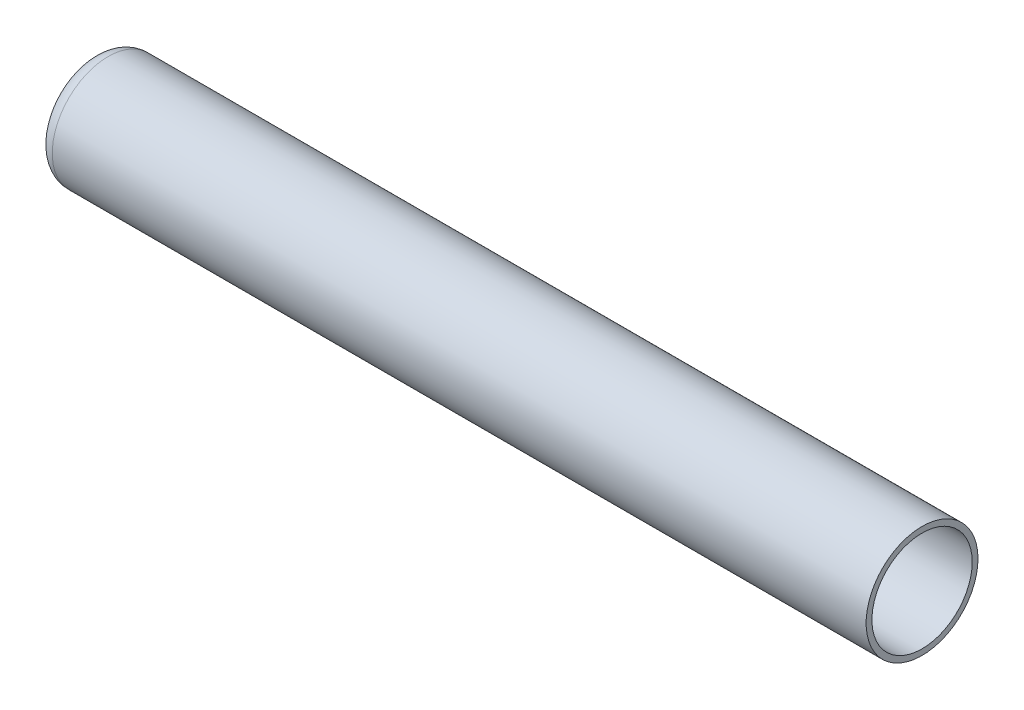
ISO-10303-21;
HEADER;
FILE_DESCRIPTION(('STEP AP214'),'2;1');
FILE_NAME('part.step','',(''),(''),'','','');
FILE_SCHEMA(('AUTOMOTIVE_DESIGN { 1 0 10303 214 1 1 1 1 }'));
ENDSEC;
DATA;
#1=APPLICATION_CONTEXT('core data for automotive mechanical design processes');
#2=APPLICATION_PROTOCOL_DEFINITION('international standard','automotive_design',2000,#1);
#3=PRODUCT_CONTEXT('',#1,'mechanical');
#4=PRODUCT('Part','Part','',(#3));
#5=PRODUCT_RELATED_PRODUCT_CATEGORY('part','',(#4));
#6=PRODUCT_DEFINITION_FORMATION('','',#4);
#7=PRODUCT_DEFINITION_CONTEXT('part definition',#1,'design');
#8=PRODUCT_DEFINITION('design','',#6,#7);
#9=PRODUCT_DEFINITION_SHAPE('','',#8);
#10=(LENGTH_UNIT() NAMED_UNIT(*) SI_UNIT(.MILLI.,.METRE.));
#11=(NAMED_UNIT(*) PLANE_ANGLE_UNIT() SI_UNIT($,.RADIAN.));
#12=(NAMED_UNIT(*) SI_UNIT($,.STERADIAN.) SOLID_ANGLE_UNIT());
#13=UNCERTAINTY_MEASURE_WITH_UNIT(LENGTH_MEASURE(1.E-05),#10,'distance_accuracy_value','');
#14=(GEOMETRIC_REPRESENTATION_CONTEXT(3) GLOBAL_UNCERTAINTY_ASSIGNED_CONTEXT((#13)) GLOBAL_UNIT_ASSIGNED_CONTEXT((#10,
#11,#12)) REPRESENTATION_CONTEXT('',''));
#15=CARTESIAN_POINT('',(0.,0.,0.));
#16=DIRECTION('',(0.,0.,1.));
#17=DIRECTION('',(1.,0.,0.));
#18=AXIS2_PLACEMENT_3D('',#15,#16,#17);
#19=CARTESIAN_POINT('',(4.,0.,0.));
#20=DIRECTION('',(1.,0.,0.));
#21=DIRECTION('',(0.,0.,-1.));
#22=AXIS2_PLACEMENT_3D('',#19,#20,#21);
#23=TOROIDAL_SURFACE('',#22,10.5,4.);
#24=CARTESIAN_POINT('',(0.,0.,0.));
#25=DIRECTION('',(1.,0.,0.));
#26=DIRECTION('',(0.,0.,-1.));
#27=AXIS2_PLACEMENT_3D('',#24,#25,#26);
#28=CIRCLE('',#27,10.5);
#29=CARTESIAN_POINT('',(0.,0.,-10.5));
#30=VERTEX_POINT('',#29);
#31=EDGE_CURVE('E10',#30,#30,#28,.T.);
#32=ORIENTED_EDGE('',*,*,#31,.T.);
#33=EDGE_LOOP('',(#32));
#34=FACE_BOUND('',#33,.T.);
#35=CARTESIAN_POINT('',(4.,0.,0.));
#36=DIRECTION('',(1.,0.,0.));
#37=DIRECTION('',(0.,0.,-1.));
#38=AXIS2_PLACEMENT_3D('',#35,#36,#37);
#39=CIRCLE('',#38,14.5);
#40=CARTESIAN_POINT('',(4.,0.,-14.5));
#41=VERTEX_POINT('',#40);
#42=EDGE_CURVE('E53',#41,#41,#39,.T.);
#43=ORIENTED_EDGE('',*,*,#42,.F.);
#44=EDGE_LOOP('',(#43));
#45=FACE_BOUND('',#44,.T.);
#46=ADVANCED_FACE('F31',(#34,#45),#23,.T.);
#47=CARTESIAN_POINT('',(0.,10.5,0.));
#48=DIRECTION('',(-1.,0.,0.));
#49=DIRECTION('',(0.,0.,1.));
#50=AXIS2_PLACEMENT_3D('',#47,#48,#49);
#51=PLANE('',#50);
#52=ORIENTED_EDGE('',*,*,#31,.F.);
#53=EDGE_LOOP('',(#52));
#54=FACE_BOUND('',#53,.T.);
#55=ADVANCED_FACE('F61',(#54),#51,.T.);
#56=CARTESIAN_POINT('',(1.49999999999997,0.,0.));
#57=DIRECTION('',(1.,0.,0.));
#58=DIRECTION('',(0.,0.,-1.));
#59=AXIS2_PLACEMENT_3D('',#56,#57,#58);
#60=PLANE('',#59);
#61=CARTESIAN_POINT('',(1.49999999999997,0.,0.));
#62=DIRECTION('',(1.,0.,0.));
#63=DIRECTION('',(0.,0.,-1.));
#64=AXIS2_PLACEMENT_3D('',#61,#62,#63);
#65=CIRCLE('',#64,10.5);
#66=CARTESIAN_POINT('',(1.49999999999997,0.,-10.5));
#67=VERTEX_POINT('',#66);
#68=EDGE_CURVE('E37',#67,#67,#65,.T.);
#69=ORIENTED_EDGE('',*,*,#68,.T.);
#70=EDGE_LOOP('',(#69));
#71=FACE_BOUND('',#70,.T.);
#72=ADVANCED_FACE('F65',(#71),#60,.T.);
#73=CARTESIAN_POINT('',(4.,0.,0.));
#74=DIRECTION('',(1.,0.,0.));
#75=DIRECTION('',(0.,0.,-1.));
#76=AXIS2_PLACEMENT_3D('',#73,#74,#75);
#77=TOROIDAL_SURFACE('',#76,10.5,2.50000000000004);
#78=CARTESIAN_POINT('',(4.,0.,0.));
#79=DIRECTION('',(1.,0.,0.));
#80=DIRECTION('',(0.,0.,-1.));
#81=AXIS2_PLACEMENT_3D('',#78,#79,#80);
#82=CIRCLE('',#81,13.);
#83=CARTESIAN_POINT('',(4.,0.,-13.));
#84=VERTEX_POINT('',#83);
#85=EDGE_CURVE('E41',#84,#84,#82,.T.);
#86=ORIENTED_EDGE('',*,*,#85,.T.);
#87=EDGE_LOOP('',(#86));
#88=FACE_BOUND('',#87,.T.);
#89=ORIENTED_EDGE('',*,*,#68,.F.);
#90=EDGE_LOOP('',(#89));
#91=FACE_BOUND('',#90,.T.);
#92=ADVANCED_FACE('F70',(#88,#91),#77,.F.);
#93=CARTESIAN_POINT('',(-0.00125000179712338,0.,0.));
#94=DIRECTION('',(1.,0.,0.));
#95=DIRECTION('',(0.,0.,-1.));
#96=AXIS2_PLACEMENT_3D('',#93,#94,#95);
#97=CYLINDRICAL_SURFACE('',#96,13.);
#98=CARTESIAN_POINT('',(215.,0.,0.));
#99=DIRECTION('',(1.,0.,0.));
#100=DIRECTION('',(0.,0.,-1.));
#101=AXIS2_PLACEMENT_3D('',#98,#99,#100);
#102=CIRCLE('',#101,13.);
#103=CARTESIAN_POINT('',(215.,0.,-13.));
#104=VERTEX_POINT('',#103);
#105=EDGE_CURVE('E45',#104,#104,#102,.T.);
#106=ORIENTED_EDGE('',*,*,#105,.T.);
#107=EDGE_LOOP('',(#106));
#108=FACE_BOUND('',#107,.T.);
#109=ORIENTED_EDGE('',*,*,#85,.F.);
#110=EDGE_LOOP('',(#109));
#111=FACE_BOUND('',#110,.T.);
#112=ADVANCED_FACE('F75',(#108,#111),#97,.F.);
#113=CARTESIAN_POINT('',(215.,13.,0.));
#114=DIRECTION('',(1.,0.,0.));
#115=DIRECTION('',(0.,0.,-1.));
#116=AXIS2_PLACEMENT_3D('',#113,#114,#115);
#117=PLANE('',#116);
#118=CARTESIAN_POINT('',(215.,0.,0.));
#119=DIRECTION('',(1.,0.,0.));
#120=DIRECTION('',(0.,0.,-1.));
#121=AXIS2_PLACEMENT_3D('',#118,#119,#120);
#122=CIRCLE('',#121,14.4999999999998);
#123=CARTESIAN_POINT('',(215.,0.,-14.4999999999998));
#124=VERTEX_POINT('',#123);
#125=EDGE_CURVE('E50',#124,#124,#122,.T.);
#126=ORIENTED_EDGE('',*,*,#125,.T.);
#127=EDGE_LOOP('',(#126));
#128=FACE_BOUND('',#127,.T.);
#129=ORIENTED_EDGE('',*,*,#105,.F.);
#130=EDGE_LOOP('',(#129));
#131=FACE_BOUND('',#130,.T.);
#132=ADVANCED_FACE('F79',(#128,#131),#117,.T.);
#133=CARTESIAN_POINT('',(-0.00125000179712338,0.,0.));
#134=DIRECTION('',(1.,0.,0.));
#135=DIRECTION('',(0.,0.,-1.));
#136=AXIS2_PLACEMENT_3D('',#133,#134,#135);
#137=CYLINDRICAL_SURFACE('',#136,14.4999999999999);
#138=ORIENTED_EDGE('',*,*,#42,.T.);
#139=EDGE_LOOP('',(#138));
#140=FACE_BOUND('',#139,.T.);
#141=ORIENTED_EDGE('',*,*,#125,.F.);
#142=EDGE_LOOP('',(#141));
#143=FACE_BOUND('',#142,.T.);
#144=ADVANCED_FACE('F57',(#140,#143),#137,.T.);
#145=CLOSED_SHELL('',(#46,#55,#72,#92,#112,#132,#144));
#146=MANIFOLD_SOLID_BREP('B2',#145);
#147=ADVANCED_BREP_SHAPE_REPRESENTATION('',(#18,#146),#14);
#148=SHAPE_DEFINITION_REPRESENTATION(#9,#147);
ENDSEC;
END-ISO-10303-21;
